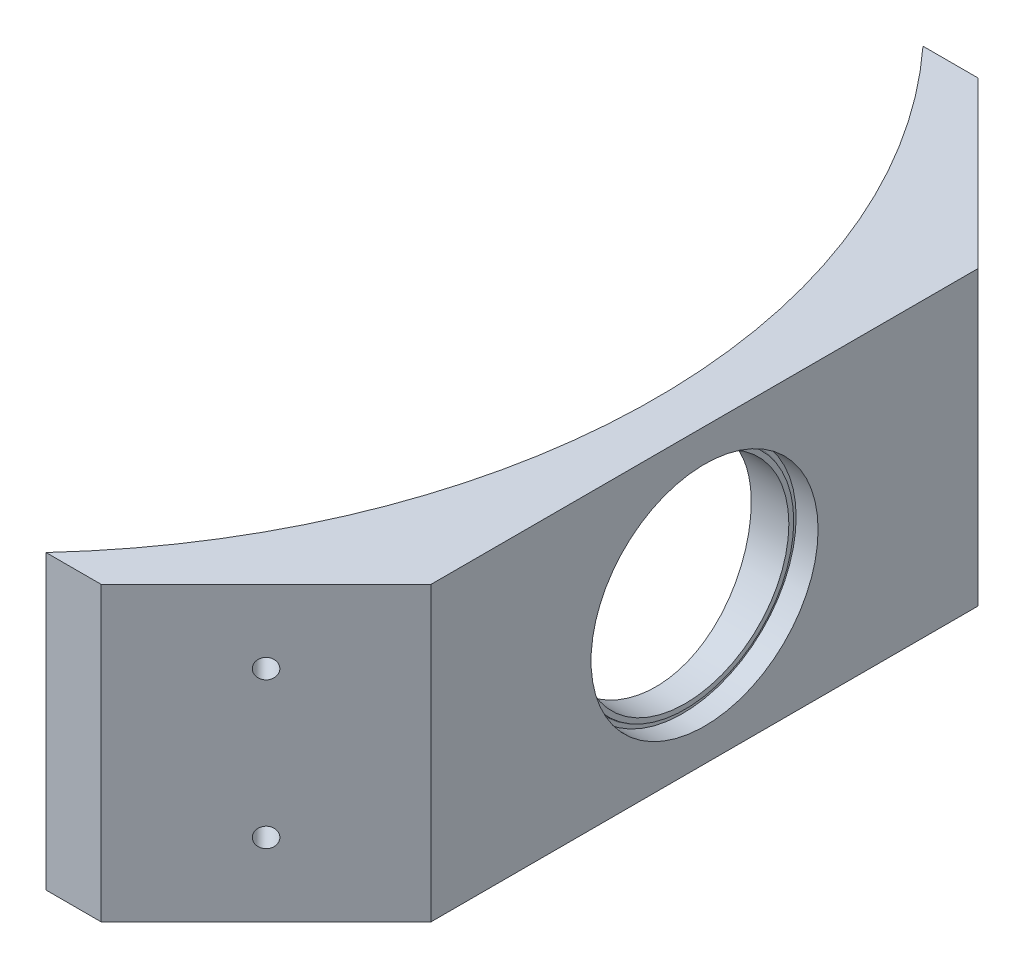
from build123d import *

# Parameters (mm, degrees)
SKETCH1_R           = 10.65
BOSS_EXTRUDE1_DEPTH = 4
CUT_EXTRUDE2_START  = -2
SKETCH4_R           = 11.65
SKETCH4_R_2         = 10.65
CUT_EXTRUDE2_DEPTH  = 2
CUT_EXTRUDE3_START  = -0.25
SKETCH5_R           = 11.65
SKETCH5_R_2         = 11.15
CUT_EXTRUDE3_DEPTH  = 0.25
FILLET1_R           = 0.1
BOSS_EXTRUDE3_DEPTH = 30
CUT_EXTRUDE6_START  = -30
SKETCH12_R          = 10.65
CUT_EXTRUDE6_DEPTH  = 30
CUT_EXTRUDE7_DEPTH  = 30
SKETCH14_R          = 1
CUT_EXTRUDE8_DEPTH  = 30
SKETCH15_R          = 1
CUT_EXTRUDE9_DEPTH  = 30


with BuildPart() as part:
    # Sketch1 → Boss-Extrude1 (new body)
    with BuildSketch(Plane(origin=(0, 0, 0), x_dir=(0, 0, -1), z_dir=(1, 0, 0))):
        Polygon((44.818066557, 64.750067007), (49.818066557, 64.750067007), (49.818066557, 34.750067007), (44.818066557, 34.750067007), (-35.181933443, 34.750067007), (-40.181933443, 34.750067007), (-40.181933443, 64.750067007), (-35.181933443, 64.750067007), align=None)
        with Locations((4.818066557, 49.750067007)):
            Circle(SKETCH1_R, mode=Mode.SUBTRACT)
    extrude(amount=BOSS_EXTRUDE1_DEPTH)

    # Sketch4 → Cut-Extrude2 (cut)
    with BuildSketch(Plane(origin=(4, 0, 0), x_dir=(0, 0, -1), z_dir=(1, 0, 0)).offset(CUT_EXTRUDE2_START)):
        with Locations((4.818066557, 49.750067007)):
            Circle(SKETCH4_R)
        with Locations((4.818066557, 49.750067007)):
            Circle(SKETCH4_R_2, mode=Mode.SUBTRACT)
    extrude(amount=CUT_EXTRUDE2_DEPTH, mode=Mode.SUBTRACT)

    # Sketch5 → Cut-Extrude3 (cut)
    with BuildSketch(Plane(origin=(2, 0, 0), x_dir=(0, 0, -1), z_dir=(1, 0, 0)).offset(CUT_EXTRUDE3_START)):
        with Locations((4.818066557, 49.750067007)):
            Circle(SKETCH5_R)
        with Locations((4.818066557, 49.750067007)):
            Circle(SKETCH5_R_2, mode=Mode.SUBTRACT)
    extrude(amount=CUT_EXTRUDE3_DEPTH, mode=Mode.SUBTRACT)

    # Fillet1
    fillet1_edges = [part.edges().sort_by_distance(p)[0] for p in [
        (1.75, 49.750067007, 6.331933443),
    ]]
    fillet(fillet1_edges, radius=FILLET1_R)

    # Sketch11 → Boss-Extrude3 (add)
    with BuildSketch(Plane(origin=(0, 64.750067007, 0), x_dir=(1, 0, 0), z_dir=(0, 1, 0))):
        with BuildLine():
            Line((0, 49.818066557), (0, -40.181933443))
            Line((0, -40.181933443), (-18.584993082, -40.181933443))
            ThreePointArc((-18.584993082, -40.181933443), (-1, 4.818066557), (-18.584993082, 49.818066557))
            Line((-18.584993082, 49.818066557), (0, 49.818066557))
        make_face()
    extrude(amount=-BOSS_EXTRUDE3_DEPTH)

    # Sketch12 → Cut-Extrude6 (cut)
    with BuildSketch(Plane(origin=(0, 0, 0), x_dir=(0, 0, -1), z_dir=(1, 0, 0)).offset(CUT_EXTRUDE6_START)):
        with Locations((4.818066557, 49.750067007)):
            Circle(SKETCH12_R)
    extrude(amount=CUT_EXTRUDE6_DEPTH, mode=Mode.SUBTRACT)

    # Sketch13 → Cut-Extrude7 (cut)
    with BuildSketch(Plane(origin=(0, 64.750067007, 0), x_dir=(1, 0, 0), z_dir=(0, 1, 0))):
        Polygon((-12.938744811, 49.818066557), (4, 32.879321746), (4, 49.818066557), align=None)
        Polygon((-12.938744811, -40.181933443), (4, -23.243188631), (4, -40.181933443), align=None)
    extrude(amount=-CUT_EXTRUDE7_DEPTH, mode=Mode.SUBTRACT)

    # Sketch14 → Cut-Extrude8 (cut)
    with BuildSketch(Plane(origin=(-109.620613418, 0, 136.863802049), x_dir=(-0.7071067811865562, 0, 0.7071067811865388), z_dir=(-0.7071067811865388, 0, -0.7071067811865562))):
        with Locations(Location((-148.70631114, 57.250067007, 0), (0, 0, 180))):
            Circle(SKETCH14_R)
        with Locations(Location((-148.70631114, 42.250067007, 0), (0, 0, 180))):
            Circle(SKETCH14_R)
    extrude(amount=CUT_EXTRUDE8_DEPTH, mode=Mode.SUBTRACT)

    # Sketch15 → Cut-Extrude9 (cut)
    with BuildSketch(Plane(origin=(18.539804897, 0, -18.339516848), x_dir=(0.7071067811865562, 0, 0.7071067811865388), z_dir=(-0.7071067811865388, 0, 0.7071067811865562))):
        with Locations(Location((-32.398265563, 57.250067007, 0), (0, 0, 180))):
            Circle(SKETCH15_R)
        with Locations(Location((-32.398265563, 42.250067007, 0), (0, 0, 180))):
            Circle(SKETCH15_R)
    extrude(amount=CUT_EXTRUDE9_DEPTH, mode=Mode.SUBTRACT)


solid = part.part
